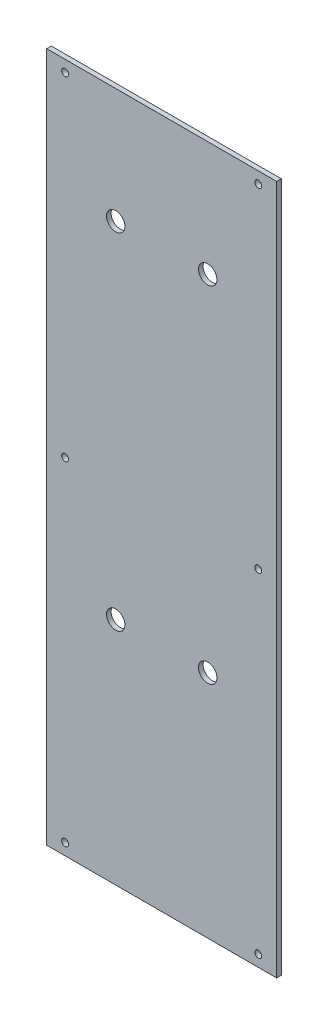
from build123d import *

# Parameters (mm, degrees)
ESQUISSE1_W                     = 100
ESQUISSE1_H                     = 300
EXTRUSION1_DEPTH                = 2
ESQUISSE3_R                     = 4
ENL_V_MAT_EXTRU_1_DEPTH         = 317.234090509
R_P_TITION_LIN_AIRE1_COUNT      = 2
R_P_TITION_LIN_AIRE1_PITCH      = 40
R_P_TITION_LIN_AIRE1_COUNT_DIR2 = 2
R_P_TITION_LIN_AIRE1_PITCH_DIR2 = 150
ESQUISSE4_R                     = 1.5
ENL_V_MAT_EXTRU_2_DEPTH         = 317.234090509
R_P_TITION_LIN_AIRE2_COUNT      = 2
R_P_TITION_LIN_AIRE2_PITCH      = 84
R_P_TITION_LIN_AIRE2_COUNT_DIR2 = 3
R_P_TITION_LIN_AIRE2_PITCH_DIR2 = 145


with BuildPart() as part:
    # Esquisse1 → Extrusion1 (new body)
    with BuildSketch(Plane.XY):
        with Locations((50, 150)):
            Rectangle(ESQUISSE1_W, ESQUISSE1_H)
    extrude(amount=EXTRUSION1_DEPTH)

    # Esquisse3 → Enl_v. mat.-Extru.1 (cut, through all)
    with BuildSketch(Plane.XY.offset(2)):
        with Locations((30, 250)):
            Circle(ESQUISSE3_R)
    enl_v_mat_extru_1 = extrude(amount=-ENL_V_MAT_EXTRU_1_DEPTH, mode=Mode.SUBTRACT)

    # R_p_tition lin_aire1: Enl_v. mat.-Extru.1 2 × 2
    with Locations(*[(i * R_P_TITION_LIN_AIRE1_PITCH, -j * R_P_TITION_LIN_AIRE1_PITCH_DIR2, 0) for i in range(R_P_TITION_LIN_AIRE1_COUNT) for j in range(R_P_TITION_LIN_AIRE1_COUNT_DIR2) if (i, j) != (0, 0)]):
        add(enl_v_mat_extru_1, mode=Mode.SUBTRACT)

    # Esquisse4 → Enl_v. mat.-Extru.2 (cut, through all)
    with BuildSketch(Plane.XY.offset(2)):
        with Locations((8, 295)):
            Circle(ESQUISSE4_R)
    enl_v_mat_extru_2 = extrude(amount=-ENL_V_MAT_EXTRU_2_DEPTH, mode=Mode.SUBTRACT)

    # R_p_tition lin_aire2: Enl_v. mat.-Extru.2 2 × 3
    with Locations(*[(i * R_P_TITION_LIN_AIRE2_PITCH, -j * R_P_TITION_LIN_AIRE2_PITCH_DIR2, 0) for i in range(R_P_TITION_LIN_AIRE2_COUNT) for j in range(R_P_TITION_LIN_AIRE2_COUNT_DIR2) if (i, j) != (0, 0)]):
        add(enl_v_mat_extru_2, mode=Mode.SUBTRACT)


solid = part.part
